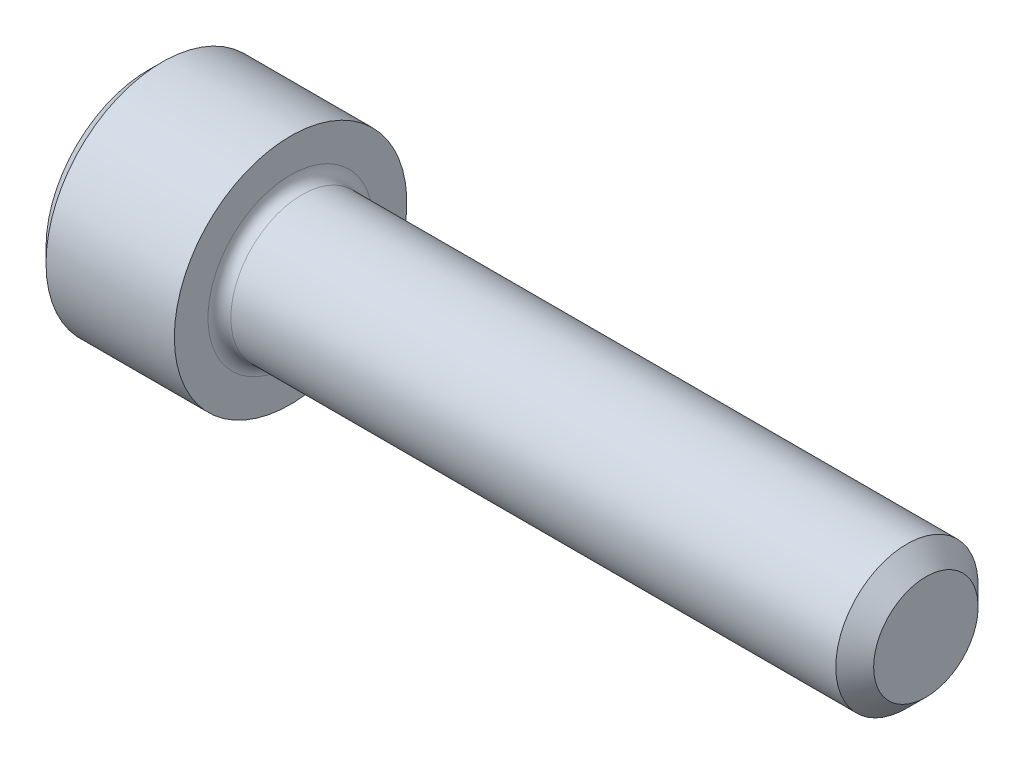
from build123d import *

# Parameters (mm, degrees)
FILLET1_R   = 0.2286
HEX_2_DEPTH = 1.2954


with BuildPart() as part:
    # BodySke → Base-Revolve (revolve)
    with BuildSketch(Plane.XY, mode=Mode.PRIVATE) as base_revolve_sk:
        Polygon((0, 0), (0, 2.0447), (0.2794, 2.3241), (2.8448, 2.3241), (2.8448, 1.4224), (15.16634, 1.4224), (15.5448, 1.04394), (15.5448, 0), align=None)
    revolve(base_revolve_sk.sketch.rotate(Axis((-31.75, 0, 0), (1, 0, 0)), 90), axis=Axis((-31.75, 0, 0), (1, 0, 0)))

    # Fillet1
    fillet1_edges = [part.edges().sort_by_distance(p)[0] for p in [
        (2.8448, 0, -1.4224),
    ]]
    fillet(fillet1_edges, radius=FILLET1_R)

    # Sketch2 → Hex-PreBroach (revolve, cut)
    with BuildSketch(Plane.XY, mode=Mode.PRIVATE) as hex_prebroach_sk:
        Polygon((0, 1.1938), (1.2954, 1.1938), (1.984640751, 0), (0, 0), align=None)
    revolve(hex_prebroach_sk.sketch.rotate(Axis((0, 0, 0), (1, 0, 0)), 270), axis=Axis((0, 0, 0), (1, 0, 0)), mode=Mode.SUBTRACT)

    # Sketch3 → Hex 2 (cut)
    with BuildSketch(Plane(origin=(0, 0, 0), x_dir=(0, 0.500000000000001, 0.866025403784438), z_dir=(-1, 0, 0))):
        Polygon((0.689240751, 1.1938), (-0.689240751, 1.1938), (-1.378481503, 0), (-0.689240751, -1.1938), (0.689240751, -1.1938), (1.378481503, 0), align=None)
    extrude(amount=-HEX_2_DEPTH, mode=Mode.SUBTRACT)


solid = part.part
